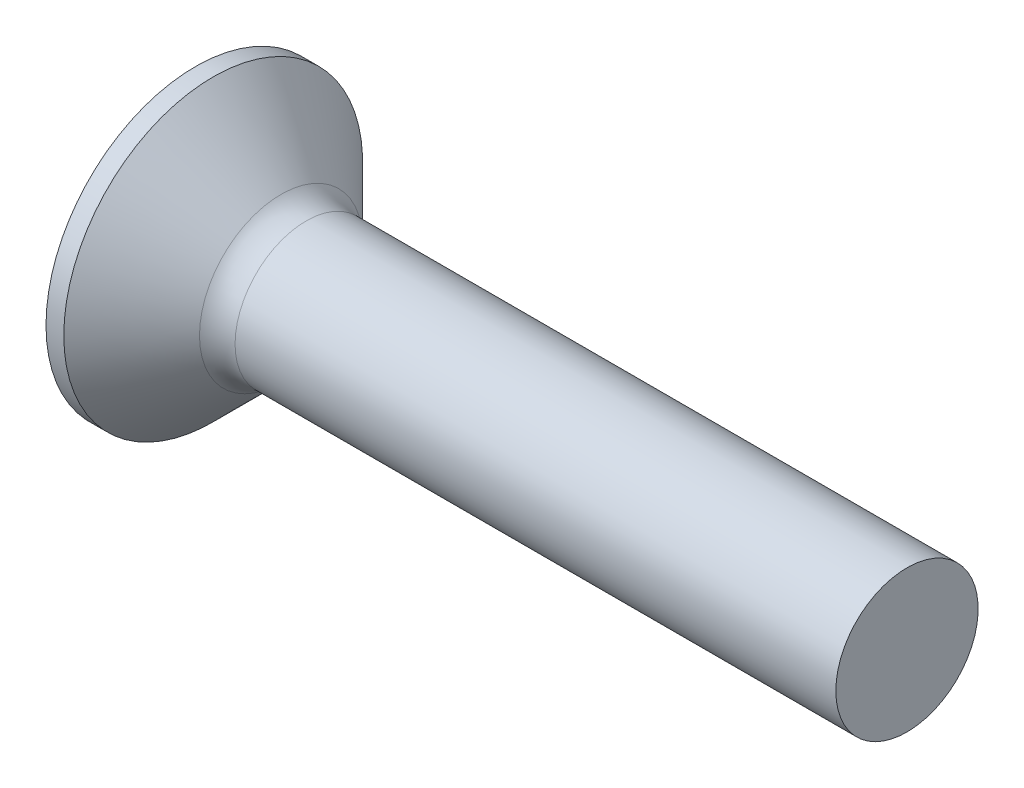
ISO-10303-21;
HEADER;
FILE_DESCRIPTION(('STEP AP214'),'2;1');
FILE_NAME('part.step','',(''),(''),'','','');
FILE_SCHEMA(('AUTOMOTIVE_DESIGN { 1 0 10303 214 1 1 1 1 }'));
ENDSEC;
DATA;
#1=APPLICATION_CONTEXT('core data for automotive mechanical design processes');
#2=APPLICATION_PROTOCOL_DEFINITION('international standard','automotive_design',2000,#1);
#3=PRODUCT_CONTEXT('',#1,'mechanical');
#4=PRODUCT('Part','Part','',(#3));
#5=PRODUCT_RELATED_PRODUCT_CATEGORY('part','',(#4));
#6=PRODUCT_DEFINITION_FORMATION('','',#4);
#7=PRODUCT_DEFINITION_CONTEXT('part definition',#1,'design');
#8=PRODUCT_DEFINITION('design','',#6,#7);
#9=PRODUCT_DEFINITION_SHAPE('','',#8);
#10=(LENGTH_UNIT() NAMED_UNIT(*) SI_UNIT(.MILLI.,.METRE.));
#11=(NAMED_UNIT(*) PLANE_ANGLE_UNIT() SI_UNIT($,.RADIAN.));
#12=(NAMED_UNIT(*) SI_UNIT($,.STERADIAN.) SOLID_ANGLE_UNIT());
#13=UNCERTAINTY_MEASURE_WITH_UNIT(LENGTH_MEASURE(1.E-05),#10,'distance_accuracy_value','');
#14=(GEOMETRIC_REPRESENTATION_CONTEXT(3) GLOBAL_UNCERTAINTY_ASSIGNED_CONTEXT((#13)) GLOBAL_UNIT_ASSIGNED_CONTEXT((#10,
#11,#12)) REPRESENTATION_CONTEXT('',''));
#15=CARTESIAN_POINT('',(0.,0.,0.));
#16=DIRECTION('',(0.,0.,1.));
#17=DIRECTION('',(1.,0.,0.));
#18=AXIS2_PLACEMENT_3D('',#15,#16,#17);
#19=CARTESIAN_POINT('',(0.,0.,0.));
#20=DIRECTION('',(-1.,0.,0.));
#21=DIRECTION('',(0.,0.,1.));
#22=AXIS2_PLACEMENT_3D('',#19,#20,#21);
#23=PLANE('',#22);
#24=CARTESIAN_POINT('',(0.,0.,0.));
#25=DIRECTION('',(-1.,0.,0.));
#26=DIRECTION('',(0.,0.,1.));
#27=AXIS2_PLACEMENT_3D('',#24,#25,#26);
#28=CIRCLE('',#27,4.2);
#29=CARTESIAN_POINT('',(0.,0.,4.2));
#30=VERTEX_POINT('',#29);
#31=EDGE_CURVE('E367',#30,#30,#28,.T.);
#32=ORIENTED_EDGE('',*,*,#31,.T.);
#33=EDGE_LOOP('',(#32));
#34=FACE_BOUND('',#33,.T.);
#35=DIRECTION('',(0.,0.,-1.));
#36=VECTOR('',#35,1.);
#37=CARTESIAN_POINT('',(0.,-0.515000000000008,2.2));
#38=LINE('',#37,#36);
#39=CARTESIAN_POINT('',(0.,-0.515000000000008,2.2));
#40=VERTEX_POINT('',#39);
#41=CARTESIAN_POINT('',(0.,-0.515000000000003,0.887981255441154));
#42=VERTEX_POINT('',#41);
#43=EDGE_CURVE('E305',#40,#42,#38,.T.);
#44=ORIENTED_EDGE('',*,*,#43,.T.);
#45=CARTESIAN_POINT('',(0.,0.,0.));
#46=DIRECTION('',(-1.,0.,0.));
#47=DIRECTION('',(0.,0.,1.));
#48=AXIS2_PLACEMENT_3D('',#45,#46,#47);
#49=CIRCLE('',#48,1.02651629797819);
#50=CARTESIAN_POINT('',(0.,-0.887981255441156,0.515));
#51=VERTEX_POINT('',#50);
#52=EDGE_CURVE('E396',#51,#42,#49,.T.);
#53=ORIENTED_EDGE('',*,*,#52,.F.);
#54=DIRECTION('',(0.,-1.,0.));
#55=VECTOR('',#54,1.);
#56=CARTESIAN_POINT('',(0.,2.2,0.515));
#57=LINE('',#56,#55);
#58=CARTESIAN_POINT('',(0.,-2.2,0.515));
#59=VERTEX_POINT('',#58);
#60=EDGE_CURVE('E331',#51,#59,#57,.T.);
#61=ORIENTED_EDGE('',*,*,#60,.T.);
#62=DIRECTION('',(0.,0.,-1.));
#63=VECTOR('',#62,1.);
#64=CARTESIAN_POINT('',(0.,-2.2,0.515));
#65=LINE('',#64,#63);
#66=CARTESIAN_POINT('',(0.,-2.2,-0.514999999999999));
#67=VERTEX_POINT('',#66);
#68=EDGE_CURVE('E336',#59,#67,#65,.T.);
#69=ORIENTED_EDGE('',*,*,#68,.T.);
#70=DIRECTION('',(0.,1.,0.));
#71=VECTOR('',#70,1.);
#72=CARTESIAN_POINT('',(0.,-2.2,-0.514999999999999));
#73=LINE('',#72,#71);
#74=CARTESIAN_POINT('',(0.,-0.887981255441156,-0.514999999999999));
#75=VERTEX_POINT('',#74);
#76=EDGE_CURVE('E332',#67,#75,#73,.T.);
#77=ORIENTED_EDGE('',*,*,#76,.T.);
#78=CARTESIAN_POINT('',(0.,-0.514999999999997,-0.887981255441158));
#79=VERTEX_POINT('',#78);
#80=EDGE_CURVE('E403',#79,#75,#49,.T.);
#81=ORIENTED_EDGE('',*,*,#80,.F.);
#82=CARTESIAN_POINT('',(0.,-0.514999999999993,-2.2));
#83=VERTEX_POINT('',#82);
#84=EDGE_CURVE('E303',#79,#83,#38,.T.);
#85=ORIENTED_EDGE('',*,*,#84,.T.);
#86=DIRECTION('',(0.,1.,0.));
#87=VECTOR('',#86,1.);
#88=CARTESIAN_POINT('',(0.,-0.514999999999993,-2.2));
#89=LINE('',#88,#87);
#90=CARTESIAN_POINT('',(0.,0.515000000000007,-2.2));
#91=VERTEX_POINT('',#90);
#92=EDGE_CURVE('E284',#83,#91,#89,.T.);
#93=ORIENTED_EDGE('',*,*,#92,.T.);
#94=DIRECTION('',(0.,0.,1.));
#95=VECTOR('',#94,1.);
#96=CARTESIAN_POINT('',(0.,0.515000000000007,-2.2));
#97=LINE('',#96,#95);
#98=CARTESIAN_POINT('',(0.,0.515000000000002,-0.887981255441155));
#99=VERTEX_POINT('',#98);
#100=EDGE_CURVE('E295',#91,#99,#97,.T.);
#101=ORIENTED_EDGE('',*,*,#100,.T.);
#102=CARTESIAN_POINT('',(0.,0.887981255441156,-0.514999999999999));
#103=VERTEX_POINT('',#102);
#104=EDGE_CURVE('E399',#103,#99,#49,.T.);
#105=ORIENTED_EDGE('',*,*,#104,.F.);
#106=CARTESIAN_POINT('',(0.,2.2,-0.514999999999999));
#107=VERTEX_POINT('',#106);
#108=EDGE_CURVE('E342',#103,#107,#73,.T.);
#109=ORIENTED_EDGE('',*,*,#108,.T.);
#110=DIRECTION('',(0.,0.,1.));
#111=VECTOR('',#110,1.);
#112=CARTESIAN_POINT('',(0.,2.2,-0.514999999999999));
#113=LINE('',#112,#111);
#114=CARTESIAN_POINT('',(0.,2.2,0.515));
#115=VERTEX_POINT('',#114);
#116=EDGE_CURVE('E328',#107,#115,#113,.T.);
#117=ORIENTED_EDGE('',*,*,#116,.T.);
#118=CARTESIAN_POINT('',(0.,0.887981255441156,0.515));
#119=VERTEX_POINT('',#118);
#120=EDGE_CURVE('E333',#115,#119,#57,.T.);
#121=ORIENTED_EDGE('',*,*,#120,.T.);
#122=CARTESIAN_POINT('',(0.,0.514999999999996,0.887981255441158));
#123=VERTEX_POINT('',#122);
#124=EDGE_CURVE('E398',#123,#119,#49,.T.);
#125=ORIENTED_EDGE('',*,*,#124,.F.);
#126=CARTESIAN_POINT('',(0.,0.514999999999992,2.2));
#127=VERTEX_POINT('',#126);
#128=EDGE_CURVE('E298',#123,#127,#97,.T.);
#129=ORIENTED_EDGE('',*,*,#128,.T.);
#130=DIRECTION('',(0.,-1.,0.));
#131=VECTOR('',#130,1.);
#132=CARTESIAN_POINT('',(0.,0.514999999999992,2.2));
#133=LINE('',#132,#131);
#134=EDGE_CURVE('E297',#127,#40,#133,.T.);
#135=ORIENTED_EDGE('',*,*,#134,.T.);
#136=EDGE_LOOP('',(#44,#53,#61,#69,#77,#81,#85,#93,#101,#105,#109,#117,#121,#125,#129,#135));
#137=FACE_BOUND('',#136,.T.);
#138=ADVANCED_FACE('F30',(#34,#137),#23,.T.);
#139=CARTESIAN_POINT('',(2.51,-0.948560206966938,0.515));
#140=DIRECTION('',(0.,0.,-1.));
#141=DIRECTION('',(0.,1.,0.));
#142=AXIS2_PLACEMENT_3D('',#139,#140,#141);
#143=PLANE('',#142);
#144=ORIENTED_EDGE('',*,*,#60,.F.);
#145=CARTESIAN_POINT('',(-1.54977564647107,-1.01130800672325,0.515));
#146=CARTESIAN_POINT('',(-1.23788517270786,-0.986826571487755,0.515));
#147=CARTESIAN_POINT('',(-0.92600773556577,-0.962176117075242,0.515));
#148=CARTESIAN_POINT('',(-0.302275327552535,-0.912414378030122,0.515));
#149=CARTESIAN_POINT('',(0.0095796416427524,-0.88730307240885,0.515));
#150=CARTESIAN_POINT('',(0.477326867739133,-0.849200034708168,0.515));
#151=CARTESIAN_POINT('',(0.633236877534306,-0.836426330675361,0.515));
#152=CARTESIAN_POINT('',(0.945041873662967,-0.810710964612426,0.515));
#153=CARTESIAN_POINT('',(1.10093686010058,-0.797769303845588,0.515));
#154=CARTESIAN_POINT('',(1.41270333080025,-0.771692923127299,0.515));
#155=CARTESIAN_POINT('',(1.568574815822,-0.758558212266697,0.515));
#156=CARTESIAN_POINT('',(1.88030267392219,-0.732062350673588,0.515));
#157=CARTESIAN_POINT('',(2.03615904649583,-0.718701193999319,0.515));
#158=CARTESIAN_POINT('',(2.39015155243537,-0.688049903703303,0.515));
#159=CARTESIAN_POINT('',(2.58828060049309,-0.670677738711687,0.515));
#160=CARTESIAN_POINT('',(2.98448796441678,-0.63539350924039,0.515));
#161=CARTESIAN_POINT('',(3.18256628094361,-0.617481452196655,0.515));
#162=CARTESIAN_POINT('',(3.57863215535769,-0.58096323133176,0.515));
#163=CARTESIAN_POINT('',(3.77661972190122,-0.562357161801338,0.515));
#164=CARTESIAN_POINT('',(4.17251625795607,-0.524212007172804,0.515));
#165=CARTESIAN_POINT('',(4.37042522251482,-0.504672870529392,0.515));
#166=CARTESIAN_POINT('',(4.76621979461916,-0.464285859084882,0.515));
#167=CARTESIAN_POINT('',(4.96410533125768,-0.443437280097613,0.515000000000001));
#168=CARTESIAN_POINT('',(5.26075347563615,-0.410686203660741,0.515000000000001));
#169=CARTESIAN_POINT('',(5.35959766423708,-0.399523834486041,0.515000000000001));
#170=CARTESIAN_POINT('',(5.55721694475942,-0.376561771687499,0.515000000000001));
#171=CARTESIAN_POINT('',(5.65599203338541,-0.364762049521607,0.515000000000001));
#172=CARTESIAN_POINT('',(5.85350341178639,-0.340311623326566,0.515000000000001));
#173=CARTESIAN_POINT('',(5.95223963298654,-0.327660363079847,0.515000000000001));
#174=CARTESIAN_POINT('',(6.14954565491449,-0.301187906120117,0.515000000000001));
#175=CARTESIAN_POINT('',(6.24811547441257,-0.28736685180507,0.515000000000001));
#176=CARTESIAN_POINT('',(6.39580251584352,-0.265292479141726,0.515000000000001));
#177=CARTESIAN_POINT('',(6.44501926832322,-0.257707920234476,0.515000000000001));
#178=CARTESIAN_POINT('',(6.54335575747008,-0.241951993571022,0.515000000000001));
#179=CARTESIAN_POINT('',(6.59247550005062,-0.233780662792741,0.515000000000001));
#180=CARTESIAN_POINT('',(6.69060451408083,-0.216664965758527,0.515000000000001));
#181=CARTESIAN_POINT('',(6.73961373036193,-0.207720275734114,0.515000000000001));
#182=CARTESIAN_POINT('',(6.83741121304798,-0.188649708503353,0.515000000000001));
#183=CARTESIAN_POINT('',(6.8861994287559,-0.17852357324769,0.515000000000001));
#184=CARTESIAN_POINT('',(6.93482152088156,-0.167602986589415,0.515000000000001));
#185=B_SPLINE_CURVE_WITH_KNOTS('',3,(#145,#146,#147,#148,#149,#150,#151,#152,#153,#154,#155,
#156,#157,#158,#159,#160,#161,#162,#163,#164,#165,#166,#167,#168,#169,#170,#171,#172,#173,#174,
#175,#176,#177,#178,#179,#180,#181,#182,#183,#184),.UNSPECIFIED.,.F.,.F.,(4,2,2,2,2,2,2,2,2,2,2,
2,2,2,2,2,2,2,2,4),(0.,0.938549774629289,1.87714240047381,2.34643955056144,2.81573317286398,
3.28500476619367,3.75428869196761,4.35095567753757,4.94761444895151,5.54419244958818,
6.14080344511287,6.73773807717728,7.0361540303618,7.33458335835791,7.63320954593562,
7.93179943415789,8.08118980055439,8.23057076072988,8.38001456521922,8.52949107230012),.UNSPECIFIED.);
#186=CARTESIAN_POINT('',(2.51,-0.677477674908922,0.514999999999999));
#187=VERTEX_POINT('',#186);
#188=EDGE_CURVE('E410',#51,#187,#185,.T.);
#189=ORIENTED_EDGE('',*,*,#188,.T.);
#190=DIRECTION('',(0.,-1.,0.));
#191=VECTOR('',#190,1.);
#192=CARTESIAN_POINT('',(2.51,0.948560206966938,0.515));
#193=LINE('',#192,#191);
#194=CARTESIAN_POINT('',(2.51,-0.948560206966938,0.515));
#195=VERTEX_POINT('',#194);
#196=EDGE_CURVE('E356',#187,#195,#193,.T.);
#197=ORIENTED_EDGE('',*,*,#196,.T.);
#198=DIRECTION('',(0.89493436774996,0.446197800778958,0.));
#199=VECTOR('',#198,1.);
#200=CARTESIAN_POINT('',(0.,-2.2,0.515));
#201=LINE('',#200,#199);
#202=EDGE_CURVE('E343',#59,#195,#201,.T.);
#203=ORIENTED_EDGE('',*,*,#202,.F.);
#204=EDGE_LOOP('',(#144,#189,#197,#203));
#205=FACE_BOUND('',#204,.T.);
#206=ADVANCED_FACE('F162',(#205),#143,.T.);
#207=CARTESIAN_POINT('',(2.51,0.948560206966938,0.515));
#208=VERTEX_POINT('',#207);
#209=CARTESIAN_POINT('',(2.51,0.677477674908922,0.514999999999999));
#210=VERTEX_POINT('',#209);
#211=EDGE_CURVE('E357',#208,#210,#193,.T.);
#212=ORIENTED_EDGE('',*,*,#211,.T.);
#213=CARTESIAN_POINT('',(-1.54977564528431,1.01130800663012,0.515));
#214=CARTESIAN_POINT('',(-1.23788517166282,0.986826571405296,0.515));
#215=CARTESIAN_POINT('',(-0.926007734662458,0.962176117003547,0.515));
#216=CARTESIAN_POINT('',(-0.302275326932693,0.91241437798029,0.515));
#217=CARTESIAN_POINT('',(0.0095796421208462,0.887303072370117,0.515));
#218=CARTESIAN_POINT('',(0.477326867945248,0.849200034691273,0.515));
#219=CARTESIAN_POINT('',(0.63323687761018,0.836426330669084,0.515));
#220=CARTESIAN_POINT('',(0.945041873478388,0.810710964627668,0.515));
#221=CARTESIAN_POINT('',(1.10093685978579,0.797769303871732,0.515));
#222=CARTESIAN_POINT('',(1.41270333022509,0.771692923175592,0.515));
#223=CARTESIAN_POINT('',(1.56857481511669,0.758558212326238,0.515));
#224=CARTESIAN_POINT('',(1.8803026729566,0.732062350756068,0.515));
#225=CARTESIAN_POINT('',(2.03615904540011,0.718701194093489,0.515));
#226=CARTESIAN_POINT('',(2.39015155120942,0.688049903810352,0.515));
#227=CARTESIAN_POINT('',(2.58828059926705,0.670677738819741,0.515));
#228=CARTESIAN_POINT('',(2.98448796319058,0.635393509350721,0.515));
#229=CARTESIAN_POINT('',(3.18256627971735,0.617481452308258,0.515));
#230=CARTESIAN_POINT('',(3.57863215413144,0.580963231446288,0.515));
#231=CARTESIAN_POINT('',(3.77661972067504,0.56235716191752,0.515));
#232=CARTESIAN_POINT('',(4.17251625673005,0.524212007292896,0.515));
#233=CARTESIAN_POINT('',(4.37042522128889,0.504672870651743,0.515));
#234=CARTESIAN_POINT('',(4.76621979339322,0.464285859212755,0.515));
#235=CARTESIAN_POINT('',(4.96410533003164,0.443437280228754,0.515));
#236=CARTESIAN_POINT('',(5.26075347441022,0.410686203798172,0.515));
#237=CARTESIAN_POINT('',(5.35959766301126,0.399523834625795,0.515));
#238=CARTESIAN_POINT('',(5.5572169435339,0.376561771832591,0.515));
#239=CARTESIAN_POINT('',(5.65599203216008,0.364762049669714,0.515000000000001));
#240=CARTESIAN_POINT('',(5.85350341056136,0.340311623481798,0.515000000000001));
#241=CARTESIAN_POINT('',(5.95223963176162,0.327660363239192,0.515000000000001));
#242=CARTESIAN_POINT('',(6.14954565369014,0.301187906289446,0.515000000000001));
#243=CARTESIAN_POINT('',(6.24811547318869,0.28736685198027,0.515000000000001));
#244=CARTESIAN_POINT('',(6.39580251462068,0.265292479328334,0.515000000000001));
#245=CARTESIAN_POINT('',(6.44501926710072,0.257707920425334,0.515000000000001));
#246=CARTESIAN_POINT('',(6.54335575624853,0.241951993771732,0.515000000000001));
#247=CARTESIAN_POINT('',(6.5924754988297,0.233780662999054,0.515000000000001));
#248=CARTESIAN_POINT('',(6.69060451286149,0.216664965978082,0.515000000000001));
#249=CARTESIAN_POINT('',(6.73961372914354,0.207720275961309,0.515000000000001));
#250=CARTESIAN_POINT('',(6.83741121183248,0.18864970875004,0.515000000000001));
#251=CARTESIAN_POINT('',(6.88619942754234,0.178523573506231,0.515000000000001));
#252=CARTESIAN_POINT('',(6.9348215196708,0.167602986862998,0.515000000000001));
#253=B_SPLINE_CURVE_WITH_KNOTS('',3,(#213,#214,#215,#216,#217,#218,#219,#220,#221,#222,#223,
#224,#225,#226,#227,#228,#229,#230,#231,#232,#233,#234,#235,#236,#237,#238,#239,#240,#241,#242,
#243,#244,#245,#246,#247,#248,#249,#250,#251,#252),.UNSPECIFIED.,.F.,.F.,(4,2,2,2,2,2,2,2,2,2,2,
2,2,2,2,2,2,2,2,4),(0.,0.938549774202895,1.87714239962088,2.34643954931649,2.81573317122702,
3.2850047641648,3.75428868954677,4.35095567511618,4.9476144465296,5.544192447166,
6.1408034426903,6.73773807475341,7.03615402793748,7.33458335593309,7.63320954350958,
7.93179943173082,8.08118979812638,8.23057075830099,8.38001456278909,8.5294910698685),.UNSPECIFIED.);
#254=EDGE_CURVE('E222',#210,#119,#253,.F.);
#255=ORIENTED_EDGE('',*,*,#254,.T.);
#256=ORIENTED_EDGE('',*,*,#120,.F.);
#257=DIRECTION('',(0.89493436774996,-0.446197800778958,0.));
#258=VECTOR('',#257,1.);
#259=CARTESIAN_POINT('',(0.,2.2,0.515));
#260=LINE('',#259,#258);
#261=EDGE_CURVE('E58',#115,#208,#260,.T.);
#262=ORIENTED_EDGE('',*,*,#261,.T.);
#263=EDGE_LOOP('',(#212,#255,#256,#262));
#264=FACE_BOUND('',#263,.T.);
#265=ADVANCED_FACE('F167',(#264),#143,.T.);
#266=CARTESIAN_POINT('',(2.51,0.948560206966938,-0.515));
#267=DIRECTION('',(0.,0.,1.));
#268=DIRECTION('',(1.,0.,0.));
#269=AXIS2_PLACEMENT_3D('',#266,#267,#268);
#270=PLANE('',#269);
#271=DIRECTION('',(0.,1.,0.));
#272=VECTOR('',#271,1.);
#273=CARTESIAN_POINT('',(2.51,-0.948560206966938,-0.515));
#274=LINE('',#273,#272);
#275=CARTESIAN_POINT('',(2.51,-0.948560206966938,-0.515));
#276=VERTEX_POINT('',#275);
#277=CARTESIAN_POINT('',(2.51,-0.677477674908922,-0.514999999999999));
#278=VERTEX_POINT('',#277);
#279=EDGE_CURVE('E307',#276,#278,#274,.T.);
#280=ORIENTED_EDGE('',*,*,#279,.T.);
#281=CARTESIAN_POINT('',(-1.54977564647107,-1.01130800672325,-0.514999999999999));
#282=CARTESIAN_POINT('',(-1.23788517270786,-0.986826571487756,-0.514999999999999));
#283=CARTESIAN_POINT('',(-0.92600773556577,-0.962176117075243,-0.514999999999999));
#284=CARTESIAN_POINT('',(-0.302275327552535,-0.912414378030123,-0.514999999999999));
#285=CARTESIAN_POINT('',(0.00957964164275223,-0.88730307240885,-0.514999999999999));
#286=CARTESIAN_POINT('',(0.477326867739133,-0.849200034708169,-0.514999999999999));
#287=CARTESIAN_POINT('',(0.633236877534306,-0.836426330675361,-0.515));
#288=CARTESIAN_POINT('',(0.945041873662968,-0.810710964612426,-0.515));
#289=CARTESIAN_POINT('',(1.10093686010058,-0.797769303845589,-0.515));
#290=CARTESIAN_POINT('',(1.41270333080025,-0.771692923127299,-0.515));
#291=CARTESIAN_POINT('',(1.568574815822,-0.758558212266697,-0.515));
#292=CARTESIAN_POINT('',(1.88030267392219,-0.732062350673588,-0.515));
#293=CARTESIAN_POINT('',(2.03615904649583,-0.718701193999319,-0.515));
#294=CARTESIAN_POINT('',(2.39015155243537,-0.688049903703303,-0.515));
#295=CARTESIAN_POINT('',(2.58828060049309,-0.670677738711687,-0.515));
#296=CARTESIAN_POINT('',(2.98448796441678,-0.63539350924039,-0.515));
#297=CARTESIAN_POINT('',(3.18256628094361,-0.617481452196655,-0.515));
#298=CARTESIAN_POINT('',(3.57863215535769,-0.58096323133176,-0.515));
#299=CARTESIAN_POINT('',(3.77661972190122,-0.562357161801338,-0.515));
#300=CARTESIAN_POINT('',(4.17251625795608,-0.524212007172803,-0.515000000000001));
#301=CARTESIAN_POINT('',(4.37042522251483,-0.504672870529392,-0.515000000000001));
#302=CARTESIAN_POINT('',(4.76621979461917,-0.464285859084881,-0.515000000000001));
#303=CARTESIAN_POINT('',(4.96410533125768,-0.443437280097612,-0.515000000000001));
#304=CARTESIAN_POINT('',(5.26075347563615,-0.410686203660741,-0.515000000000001));
#305=CARTESIAN_POINT('',(5.35959766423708,-0.39952383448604,-0.515000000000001));
#306=CARTESIAN_POINT('',(5.55721694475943,-0.376561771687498,-0.515000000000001));
#307=CARTESIAN_POINT('',(5.65599203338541,-0.364762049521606,-0.515000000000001));
#308=CARTESIAN_POINT('',(5.8535034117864,-0.340311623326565,-0.515000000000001));
#309=CARTESIAN_POINT('',(5.95223963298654,-0.327660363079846,-0.515000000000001));
#310=CARTESIAN_POINT('',(6.14954565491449,-0.301187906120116,-0.515000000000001));
#311=CARTESIAN_POINT('',(6.24811547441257,-0.287366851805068,-0.515000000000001));
#312=CARTESIAN_POINT('',(6.39580251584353,-0.265292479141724,-0.515000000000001));
#313=CARTESIAN_POINT('',(6.44501926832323,-0.257707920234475,-0.515000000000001));
#314=CARTESIAN_POINT('',(6.54335575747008,-0.24195199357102,-0.515000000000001));
#315=CARTESIAN_POINT('',(6.59247550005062,-0.233780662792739,-0.515000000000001));
#316=CARTESIAN_POINT('',(6.69060451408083,-0.216664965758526,-0.515000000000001));
#317=CARTESIAN_POINT('',(6.73961373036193,-0.207720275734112,-0.515000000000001));
#318=CARTESIAN_POINT('',(6.83741121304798,-0.188649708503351,-0.515000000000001));
#319=CARTESIAN_POINT('',(6.88619942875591,-0.178523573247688,-0.515000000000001));
#320=CARTESIAN_POINT('',(6.93482152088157,-0.167602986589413,-0.515000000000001));
#321=B_SPLINE_CURVE_WITH_KNOTS('',3,(#281,#282,#283,#284,#285,#286,#287,#288,#289,#290,#291,
#292,#293,#294,#295,#296,#297,#298,#299,#300,#301,#302,#303,#304,#305,#306,#307,#308,#309,#310,
#311,#312,#313,#314,#315,#316,#317,#318,#319,#320),.UNSPECIFIED.,.F.,.F.,(4,2,2,2,2,2,2,2,2,2,2,
2,2,2,2,2,2,2,2,4),(0.,0.938549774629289,1.87714240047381,2.34643955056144,2.81573317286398,
3.28500476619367,3.75428869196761,4.35095567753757,4.94761444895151,5.54419244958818,
6.14080344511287,6.73773807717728,7.0361540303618,7.33458335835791,7.63320954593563,
7.93179943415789,8.0811898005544,8.23057076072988,8.38001456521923,8.52949107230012),.UNSPECIFIED.);
#322=EDGE_CURVE('E216',#278,#75,#321,.F.);
#323=ORIENTED_EDGE('',*,*,#322,.T.);
#324=ORIENTED_EDGE('',*,*,#76,.F.);
#325=DIRECTION('',(0.89493436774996,0.446197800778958,0.));
#326=VECTOR('',#325,1.);
#327=CARTESIAN_POINT('',(0.,-2.2,-0.514999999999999));
#328=LINE('',#327,#326);
#329=EDGE_CURVE('E346',#67,#276,#328,.T.);
#330=ORIENTED_EDGE('',*,*,#329,.T.);
#331=EDGE_LOOP('',(#280,#323,#324,#330));
#332=FACE_BOUND('',#331,.T.);
#333=ADVANCED_FACE('F202',(#332),#270,.T.);
#334=ORIENTED_EDGE('',*,*,#108,.F.);
#335=CARTESIAN_POINT('',(-1.54977564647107,1.01130800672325,-0.514999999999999));
#336=CARTESIAN_POINT('',(-1.23788517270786,0.986826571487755,-0.514999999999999));
#337=CARTESIAN_POINT('',(-0.92600773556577,0.962176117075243,-0.514999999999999));
#338=CARTESIAN_POINT('',(-0.302275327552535,0.912414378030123,-0.514999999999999));
#339=CARTESIAN_POINT('',(0.00957964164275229,0.88730307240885,-0.514999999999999));
#340=CARTESIAN_POINT('',(0.477326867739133,0.849200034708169,-0.514999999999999));
#341=CARTESIAN_POINT('',(0.633236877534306,0.836426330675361,-0.515));
#342=CARTESIAN_POINT('',(0.945041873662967,0.810710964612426,-0.515));
#343=CARTESIAN_POINT('',(1.10093686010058,0.797769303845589,-0.515));
#344=CARTESIAN_POINT('',(1.41270333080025,0.771692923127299,-0.515));
#345=CARTESIAN_POINT('',(1.568574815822,0.758558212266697,-0.515));
#346=CARTESIAN_POINT('',(1.88030267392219,0.732062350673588,-0.515));
#347=CARTESIAN_POINT('',(2.03615904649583,0.718701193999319,-0.515));
#348=CARTESIAN_POINT('',(2.39015155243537,0.688049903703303,-0.515));
#349=CARTESIAN_POINT('',(2.58828060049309,0.670677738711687,-0.515));
#350=CARTESIAN_POINT('',(2.98448796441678,0.63539350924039,-0.515));
#351=CARTESIAN_POINT('',(3.18256628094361,0.617481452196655,-0.515));
#352=CARTESIAN_POINT('',(3.57863215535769,0.58096323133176,-0.515));
#353=CARTESIAN_POINT('',(3.77661972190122,0.562357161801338,-0.515));
#354=CARTESIAN_POINT('',(4.17251625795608,0.524212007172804,-0.515000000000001));
#355=CARTESIAN_POINT('',(4.37042522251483,0.504672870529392,-0.515000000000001));
#356=CARTESIAN_POINT('',(4.76621979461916,0.464285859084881,-0.515000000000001));
#357=CARTESIAN_POINT('',(4.96410533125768,0.443437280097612,-0.515000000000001));
#358=CARTESIAN_POINT('',(5.26075347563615,0.410686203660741,-0.515000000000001));
#359=CARTESIAN_POINT('',(5.35959766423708,0.39952383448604,-0.515000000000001));
#360=CARTESIAN_POINT('',(5.55721694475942,0.376561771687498,-0.515000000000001));
#361=CARTESIAN_POINT('',(5.65599203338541,0.364762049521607,-0.515000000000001));
#362=CARTESIAN_POINT('',(5.8535034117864,0.340311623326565,-0.515000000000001));
#363=CARTESIAN_POINT('',(5.95223963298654,0.327660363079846,-0.515000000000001));
#364=CARTESIAN_POINT('',(6.14954565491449,0.301187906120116,-0.515000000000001));
#365=CARTESIAN_POINT('',(6.24811547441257,0.287366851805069,-0.515000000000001));
#366=CARTESIAN_POINT('',(6.39580251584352,0.265292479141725,-0.515000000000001));
#367=CARTESIAN_POINT('',(6.44501926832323,0.257707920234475,-0.515000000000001));
#368=CARTESIAN_POINT('',(6.54335575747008,0.24195199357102,-0.515000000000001));
#369=CARTESIAN_POINT('',(6.59247550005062,0.233780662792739,-0.515000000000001));
#370=CARTESIAN_POINT('',(6.69060451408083,0.216664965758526,-0.515000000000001));
#371=CARTESIAN_POINT('',(6.73961373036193,0.207720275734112,-0.515000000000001));
#372=CARTESIAN_POINT('',(6.83741121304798,0.188649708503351,-0.515000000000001));
#373=CARTESIAN_POINT('',(6.88619942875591,0.178523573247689,-0.515000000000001));
#374=CARTESIAN_POINT('',(6.93482152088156,0.167602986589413,-0.515000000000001));
#375=B_SPLINE_CURVE_WITH_KNOTS('',3,(#335,#336,#337,#338,#339,#340,#341,#342,#343,#344,#345,
#346,#347,#348,#349,#350,#351,#352,#353,#354,#355,#356,#357,#358,#359,#360,#361,#362,#363,#364,
#365,#366,#367,#368,#369,#370,#371,#372,#373,#374),.UNSPECIFIED.,.F.,.F.,(4,2,2,2,2,2,2,2,2,2,2,
2,2,2,2,2,2,2,2,4),(0.,0.938549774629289,1.87714240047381,2.34643955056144,2.81573317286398,
3.28500476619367,3.75428869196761,4.35095567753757,4.94761444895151,5.54419244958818,
6.14080344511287,6.73773807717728,7.0361540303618,7.33458335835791,7.63320954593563,
7.93179943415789,8.0811898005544,8.23057076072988,8.38001456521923,8.52949107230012),.UNSPECIFIED.);
#376=CARTESIAN_POINT('',(2.51,0.677477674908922,-0.514999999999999));
#377=VERTEX_POINT('',#376);
#378=EDGE_CURVE('E210',#103,#377,#375,.T.);
#379=ORIENTED_EDGE('',*,*,#378,.T.);
#380=CARTESIAN_POINT('',(2.51,0.948560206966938,-0.515));
#381=VERTEX_POINT('',#380);
#382=EDGE_CURVE('E304',#377,#381,#274,.T.);
#383=ORIENTED_EDGE('',*,*,#382,.T.);
#384=DIRECTION('',(0.89493436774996,-0.446197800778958,0.));
#385=VECTOR('',#384,1.);
#386=CARTESIAN_POINT('',(0.,2.2,-0.514999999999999));
#387=LINE('',#386,#385);
#388=EDGE_CURVE('E350',#107,#381,#387,.T.);
#389=ORIENTED_EDGE('',*,*,#388,.F.);
#390=EDGE_LOOP('',(#334,#379,#383,#389));
#391=FACE_BOUND('',#390,.T.);
#392=ADVANCED_FACE('F194',(#391),#270,.T.);
#393=CARTESIAN_POINT('',(2.51,-0.948560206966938,-0.515));
#394=DIRECTION('',(-1.,0.,0.));
#395=DIRECTION('',(0.,0.,1.));
#396=AXIS2_PLACEMENT_3D('',#393,#394,#395);
#397=PLANE('',#396);
#398=ORIENTED_EDGE('',*,*,#196,.F.);
#399=CARTESIAN_POINT('',(2.51,0.,0.));
#400=DIRECTION('',(-1.,0.,0.));
#401=DIRECTION('',(0.,0.,1.));
#402=AXIS2_PLACEMENT_3D('',#399,#400,#401);
#403=CIRCLE('',#402,0.850999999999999);
#404=EDGE_CURVE('E387',#278,#187,#403,.T.);
#405=ORIENTED_EDGE('',*,*,#404,.F.);
#406=ORIENTED_EDGE('',*,*,#279,.F.);
#407=DIRECTION('',(0.,0.,-1.));
#408=VECTOR('',#407,1.);
#409=CARTESIAN_POINT('',(2.51,-0.948560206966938,0.515));
#410=LINE('',#409,#408);
#411=EDGE_CURVE('E353',#195,#276,#410,.T.);
#412=ORIENTED_EDGE('',*,*,#411,.F.);
#413=EDGE_LOOP('',(#398,#405,#406,#412));
#414=FACE_BOUND('',#413,.T.);
#415=ADVANCED_FACE('F190',(#414),#397,.T.);
#416=DIRECTION('',(0.,0.,-1.));
#417=VECTOR('',#416,1.);
#418=CARTESIAN_POINT('',(2.51,-0.515000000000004,0.948560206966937));
#419=LINE('',#418,#417);
#420=CARTESIAN_POINT('',(2.51,-0.514999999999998,-0.677477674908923));
#421=VERTEX_POINT('',#420);
#422=CARTESIAN_POINT('',(2.51,-0.514999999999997,-0.94856020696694));
#423=VERTEX_POINT('',#422);
#424=EDGE_CURVE('E320',#421,#423,#419,.T.);
#425=ORIENTED_EDGE('',*,*,#424,.F.);
#426=CARTESIAN_POINT('',(2.51,0.515000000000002,-0.677477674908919));
#427=VERTEX_POINT('',#426);
#428=EDGE_CURVE('E394',#427,#421,#403,.T.);
#429=ORIENTED_EDGE('',*,*,#428,.F.);
#430=DIRECTION('',(0.,0.,1.));
#431=VECTOR('',#430,1.);
#432=CARTESIAN_POINT('',(2.51,0.515000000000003,-0.948560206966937));
#433=LINE('',#432,#431);
#434=CARTESIAN_POINT('',(2.51,0.515000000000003,-0.948560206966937));
#435=VERTEX_POINT('',#434);
#436=EDGE_CURVE('E321',#435,#427,#433,.T.);
#437=ORIENTED_EDGE('',*,*,#436,.F.);
#438=DIRECTION('',(0.,1.,0.));
#439=VECTOR('',#438,1.);
#440=CARTESIAN_POINT('',(2.51,-0.514999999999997,-0.94856020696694));
#441=LINE('',#440,#439);
#442=EDGE_CURVE('E287',#423,#435,#441,.T.);
#443=ORIENTED_EDGE('',*,*,#442,.F.);
#444=EDGE_LOOP('',(#425,#429,#437,#443));
#445=FACE_BOUND('',#444,.T.);
#446=ADVANCED_FACE('F193',(#445),#397,.T.);
#447=ORIENTED_EDGE('',*,*,#382,.F.);
#448=EDGE_CURVE('E397',#210,#377,#403,.T.);
#449=ORIENTED_EDGE('',*,*,#448,.F.);
#450=ORIENTED_EDGE('',*,*,#211,.F.);
#451=DIRECTION('',(0.,0.,1.));
#452=VECTOR('',#451,1.);
#453=CARTESIAN_POINT('',(2.51,0.948560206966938,-0.515));
#454=LINE('',#453,#452);
#455=EDGE_CURVE('E354',#381,#208,#454,.T.);
#456=ORIENTED_EDGE('',*,*,#455,.F.);
#457=EDGE_LOOP('',(#447,#449,#450,#456));
#458=FACE_BOUND('',#457,.T.);
#459=ADVANCED_FACE('F426',(#458),#397,.T.);
#460=CARTESIAN_POINT('',(2.51,0.514999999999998,0.677477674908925));
#461=VERTEX_POINT('',#460);
#462=CARTESIAN_POINT('',(2.51,0.514999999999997,0.94856020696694));
#463=VERTEX_POINT('',#462);
#464=EDGE_CURVE('E327',#461,#463,#433,.T.);
#465=ORIENTED_EDGE('',*,*,#464,.F.);
#466=CARTESIAN_POINT('',(2.51,-0.515000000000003,0.677477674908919));
#467=VERTEX_POINT('',#466);
#468=EDGE_CURVE('E395',#467,#461,#403,.T.);
#469=ORIENTED_EDGE('',*,*,#468,.F.);
#470=CARTESIAN_POINT('',(2.51,-0.515000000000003,0.948560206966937));
#471=VERTEX_POINT('',#470);
#472=EDGE_CURVE('E322',#471,#467,#419,.T.);
#473=ORIENTED_EDGE('',*,*,#472,.F.);
#474=DIRECTION('',(0.,-1.,0.));
#475=VECTOR('',#474,1.);
#476=CARTESIAN_POINT('',(2.51,0.514999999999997,0.94856020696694));
#477=LINE('',#476,#475);
#478=EDGE_CURVE('E317',#463,#471,#477,.T.);
#479=ORIENTED_EDGE('',*,*,#478,.F.);
#480=EDGE_LOOP('',(#465,#469,#473,#479));
#481=FACE_BOUND('',#480,.T.);
#482=ADVANCED_FACE('F196',(#481),#397,.T.);
#483=CARTESIAN_POINT('',(2.51,-0.514999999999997,-0.94856020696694));
#484=DIRECTION('',(0.,1.,0.));
#485=DIRECTION('',(0.,0.,1.));
#486=AXIS2_PLACEMENT_3D('',#483,#484,#485);
#487=PLANE('',#486);
#488=ORIENTED_EDGE('',*,*,#84,.F.);
#489=CARTESIAN_POINT('',(-1.54977564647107,-0.514999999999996,-1.01130800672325));
#490=CARTESIAN_POINT('',(-1.23788517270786,-0.514999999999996,-0.986826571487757));
#491=CARTESIAN_POINT('',(-0.92600773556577,-0.514999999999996,-0.962176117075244));
#492=CARTESIAN_POINT('',(-0.302275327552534,-0.514999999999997,-0.912414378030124));
#493=CARTESIAN_POINT('',(0.00957964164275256,-0.514999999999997,-0.887303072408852));
#494=CARTESIAN_POINT('',(0.477326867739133,-0.514999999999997,-0.84920003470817));
#495=CARTESIAN_POINT('',(0.633236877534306,-0.514999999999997,-0.836426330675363));
#496=CARTESIAN_POINT('',(0.945041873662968,-0.514999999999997,-0.810710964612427));
#497=CARTESIAN_POINT('',(1.10093686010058,-0.514999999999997,-0.79776930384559));
#498=CARTESIAN_POINT('',(1.41270333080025,-0.514999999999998,-0.771692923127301));
#499=CARTESIAN_POINT('',(1.568574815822,-0.514999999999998,-0.758558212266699));
#500=CARTESIAN_POINT('',(1.88030267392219,-0.514999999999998,-0.73206235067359));
#501=CARTESIAN_POINT('',(2.03615904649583,-0.514999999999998,-0.718701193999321));
#502=CARTESIAN_POINT('',(2.39015155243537,-0.514999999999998,-0.688049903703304));
#503=CARTESIAN_POINT('',(2.58828060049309,-0.514999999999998,-0.670677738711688));
#504=CARTESIAN_POINT('',(2.98448796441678,-0.514999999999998,-0.635393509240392));
#505=CARTESIAN_POINT('',(3.18256628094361,-0.514999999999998,-0.617481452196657));
#506=CARTESIAN_POINT('',(3.57863215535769,-0.514999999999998,-0.580963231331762));
#507=CARTESIAN_POINT('',(3.77661972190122,-0.514999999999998,-0.56235716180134));
#508=CARTESIAN_POINT('',(4.17251625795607,-0.514999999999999,-0.524212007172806));
#509=CARTESIAN_POINT('',(4.37042522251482,-0.514999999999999,-0.504672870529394));
#510=CARTESIAN_POINT('',(4.76621979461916,-0.514999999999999,-0.464285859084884));
#511=CARTESIAN_POINT('',(4.96410533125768,-0.514999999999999,-0.443437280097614));
#512=CARTESIAN_POINT('',(5.26075347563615,-0.514999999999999,-0.410686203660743));
#513=CARTESIAN_POINT('',(5.35959766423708,-0.514999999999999,-0.399523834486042));
#514=CARTESIAN_POINT('',(5.55721694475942,-0.514999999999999,-0.3765617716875));
#515=CARTESIAN_POINT('',(5.65599203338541,-0.514999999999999,-0.364762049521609));
#516=CARTESIAN_POINT('',(5.8535034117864,-0.514999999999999,-0.340311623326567));
#517=CARTESIAN_POINT('',(5.95223963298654,-0.514999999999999,-0.327660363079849));
#518=CARTESIAN_POINT('',(6.14954565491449,-0.515,-0.301187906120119));
#519=CARTESIAN_POINT('',(6.24811547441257,-0.515,-0.287366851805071));
#520=CARTESIAN_POINT('',(6.39580251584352,-0.515,-0.265292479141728));
#521=CARTESIAN_POINT('',(6.44501926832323,-0.515,-0.257707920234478));
#522=CARTESIAN_POINT('',(6.54335575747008,-0.515,-0.241951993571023));
#523=CARTESIAN_POINT('',(6.59247550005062,-0.515,-0.233780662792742));
#524=CARTESIAN_POINT('',(6.69060451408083,-0.515,-0.216664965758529));
#525=CARTESIAN_POINT('',(6.73961373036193,-0.515,-0.207720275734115));
#526=CARTESIAN_POINT('',(6.83741121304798,-0.515,-0.188649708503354));
#527=CARTESIAN_POINT('',(6.88619942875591,-0.515,-0.178523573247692));
#528=CARTESIAN_POINT('',(6.93482152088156,-0.515,-0.167602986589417));
#529=B_SPLINE_CURVE_WITH_KNOTS('',3,(#489,#490,#491,#492,#493,#494,#495,#496,#497,#498,#499,
#500,#501,#502,#503,#504,#505,#506,#507,#508,#509,#510,#511,#512,#513,#514,#515,#516,#517,#518,
#519,#520,#521,#522,#523,#524,#525,#526,#527,#528),.UNSPECIFIED.,.F.,.F.,(4,2,2,2,2,2,2,2,2,2,2,
2,2,2,2,2,2,2,2,4),(0.,0.938549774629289,1.87714240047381,2.34643955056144,2.81573317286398,
3.28500476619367,3.75428869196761,4.35095567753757,4.94761444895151,5.54419244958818,
6.14080344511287,6.73773807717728,7.03615403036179,7.33458335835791,7.63320954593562,
7.93179943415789,8.08118980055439,8.23057076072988,8.38001456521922,8.52949107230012),.UNSPECIFIED.);
#530=EDGE_CURVE('E247',#79,#421,#529,.T.);
#531=ORIENTED_EDGE('',*,*,#530,.T.);
#532=ORIENTED_EDGE('',*,*,#424,.T.);
#533=DIRECTION('',(0.89493436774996,0.,0.446197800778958));
#534=VECTOR('',#533,1.);
#535=CARTESIAN_POINT('',(0.,-0.514999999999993,-2.2));
#536=LINE('',#535,#534);
#537=EDGE_CURVE('E290',#83,#423,#536,.T.);
#538=ORIENTED_EDGE('',*,*,#537,.F.);
#539=EDGE_LOOP('',(#488,#531,#532,#538));
#540=FACE_BOUND('',#539,.T.);
#541=ADVANCED_FACE('F253',(#540),#487,.T.);
#542=CARTESIAN_POINT('',(2.51,0.514999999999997,0.94856020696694));
#543=DIRECTION('',(0.,-1.,0.));
#544=DIRECTION('',(1.,0.,0.));
#545=AXIS2_PLACEMENT_3D('',#542,#543,#544);
#546=PLANE('',#545);
#547=ORIENTED_EDGE('',*,*,#436,.T.);
#548=CARTESIAN_POINT('',(-1.54977564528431,0.515000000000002,-1.01130800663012));
#549=CARTESIAN_POINT('',(-1.23788517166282,0.515000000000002,-0.986826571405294));
#550=CARTESIAN_POINT('',(-0.926007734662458,0.515000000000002,-0.962176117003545));
#551=CARTESIAN_POINT('',(-0.302275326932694,0.515000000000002,-0.912414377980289));
#552=CARTESIAN_POINT('',(0.00957964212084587,0.515000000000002,-0.887303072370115));
#553=CARTESIAN_POINT('',(0.477326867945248,0.515000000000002,-0.849200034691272));
#554=CARTESIAN_POINT('',(0.63323687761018,0.515000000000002,-0.836426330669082));
#555=CARTESIAN_POINT('',(0.945041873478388,0.515000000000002,-0.810710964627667));
#556=CARTESIAN_POINT('',(1.10093685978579,0.515000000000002,-0.79776930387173));
#557=CARTESIAN_POINT('',(1.41270333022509,0.515000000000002,-0.77169292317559));
#558=CARTESIAN_POINT('',(1.56857481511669,0.515000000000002,-0.758558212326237));
#559=CARTESIAN_POINT('',(1.8803026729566,0.515000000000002,-0.732062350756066));
#560=CARTESIAN_POINT('',(2.03615904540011,0.515000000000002,-0.718701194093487));
#561=CARTESIAN_POINT('',(2.39015155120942,0.515000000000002,-0.68804990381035));
#562=CARTESIAN_POINT('',(2.58828059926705,0.515000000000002,-0.670677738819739));
#563=CARTESIAN_POINT('',(2.98448796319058,0.515000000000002,-0.635393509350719));
#564=CARTESIAN_POINT('',(3.18256627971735,0.515000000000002,-0.617481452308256));
#565=CARTESIAN_POINT('',(3.57863215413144,0.515000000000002,-0.580963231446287));
#566=CARTESIAN_POINT('',(3.77661972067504,0.515000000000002,-0.562357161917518));
#567=CARTESIAN_POINT('',(4.17251625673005,0.515000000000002,-0.524212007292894));
#568=CARTESIAN_POINT('',(4.37042522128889,0.515000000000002,-0.504672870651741));
#569=CARTESIAN_POINT('',(4.76621979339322,0.515000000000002,-0.464285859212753));
#570=CARTESIAN_POINT('',(4.96410533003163,0.515000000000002,-0.443437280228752));
#571=CARTESIAN_POINT('',(5.26075347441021,0.515000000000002,-0.410686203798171));
#572=CARTESIAN_POINT('',(5.35959766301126,0.515000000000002,-0.399523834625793));
#573=CARTESIAN_POINT('',(5.5572169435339,0.515000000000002,-0.376561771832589));
#574=CARTESIAN_POINT('',(5.65599203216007,0.515000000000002,-0.364762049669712));
#575=CARTESIAN_POINT('',(5.85350341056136,0.515000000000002,-0.340311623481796));
#576=CARTESIAN_POINT('',(5.95223963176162,0.515000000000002,-0.32766036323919));
#577=CARTESIAN_POINT('',(6.14954565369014,0.515000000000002,-0.301187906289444));
#578=CARTESIAN_POINT('',(6.24811547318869,0.515000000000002,-0.287366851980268));
#579=CARTESIAN_POINT('',(6.39580251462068,0.515000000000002,-0.265292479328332));
#580=CARTESIAN_POINT('',(6.44501926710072,0.515000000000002,-0.257707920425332));
#581=CARTESIAN_POINT('',(6.54335575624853,0.515000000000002,-0.24195199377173));
#582=CARTESIAN_POINT('',(6.5924754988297,0.515000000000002,-0.233780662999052));
#583=CARTESIAN_POINT('',(6.69060451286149,0.515000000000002,-0.216664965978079));
#584=CARTESIAN_POINT('',(6.73961372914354,0.515000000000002,-0.207720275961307));
#585=CARTESIAN_POINT('',(6.83741121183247,0.515000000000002,-0.188649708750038));
#586=CARTESIAN_POINT('',(6.88619942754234,0.515000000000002,-0.178523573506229));
#587=CARTESIAN_POINT('',(6.9348215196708,0.515000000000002,-0.167602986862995));
#588=B_SPLINE_CURVE_WITH_KNOTS('',3,(#548,#549,#550,#551,#552,#553,#554,#555,#556,#557,#558,
#559,#560,#561,#562,#563,#564,#565,#566,#567,#568,#569,#570,#571,#572,#573,#574,#575,#576,#577,
#578,#579,#580,#581,#582,#583,#584,#585,#586,#587),.UNSPECIFIED.,.F.,.F.,(4,2,2,2,2,2,2,2,2,2,2,
2,2,2,2,2,2,2,2,4),(0.,0.938549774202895,1.87714239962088,2.34643954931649,2.81573317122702,
3.2850047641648,3.75428868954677,4.35095567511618,4.9476144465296,5.544192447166,
6.1408034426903,6.7377380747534,7.03615402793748,7.33458335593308,7.63320954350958,
7.93179943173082,8.08118979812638,8.23057075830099,8.38001456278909,8.5294910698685),.UNSPECIFIED.);
#589=EDGE_CURVE('E242',#427,#99,#588,.F.);
#590=ORIENTED_EDGE('',*,*,#589,.T.);
#591=ORIENTED_EDGE('',*,*,#100,.F.);
#592=DIRECTION('',(0.89493436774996,0.,0.446197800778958));
#593=VECTOR('',#592,1.);
#594=CARTESIAN_POINT('',(0.,0.515000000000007,-2.2));
#595=LINE('',#594,#593);
#596=EDGE_CURVE('E280',#91,#435,#595,.T.);
#597=ORIENTED_EDGE('',*,*,#596,.T.);
#598=EDGE_LOOP('',(#547,#590,#591,#597));
#599=FACE_BOUND('',#598,.T.);
#600=ADVANCED_FACE('F256',(#599),#546,.T.);
#601=ORIENTED_EDGE('',*,*,#472,.T.);
#602=CARTESIAN_POINT('',(-1.54977564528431,-0.515000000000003,1.01130800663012));
#603=CARTESIAN_POINT('',(-1.23788517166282,-0.515000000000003,0.986826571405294));
#604=CARTESIAN_POINT('',(-0.926007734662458,-0.515000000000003,0.962176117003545));
#605=CARTESIAN_POINT('',(-0.302275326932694,-0.515000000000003,0.912414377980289));
#606=CARTESIAN_POINT('',(0.00957964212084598,-0.515000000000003,0.887303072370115));
#607=CARTESIAN_POINT('',(0.477326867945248,-0.515000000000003,0.849200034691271));
#608=CARTESIAN_POINT('',(0.633236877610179,-0.515000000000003,0.836426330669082));
#609=CARTESIAN_POINT('',(0.945041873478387,-0.515000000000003,0.810710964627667));
#610=CARTESIAN_POINT('',(1.10093685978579,-0.515000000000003,0.79776930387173));
#611=CARTESIAN_POINT('',(1.41270333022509,-0.515000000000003,0.77169292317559));
#612=CARTESIAN_POINT('',(1.56857481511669,-0.515000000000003,0.758558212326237));
#613=CARTESIAN_POINT('',(1.8803026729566,-0.515000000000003,0.732062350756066));
#614=CARTESIAN_POINT('',(2.03615904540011,-0.515000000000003,0.718701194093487));
#615=CARTESIAN_POINT('',(2.39015155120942,-0.515000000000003,0.68804990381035));
#616=CARTESIAN_POINT('',(2.58828059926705,-0.515000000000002,0.670677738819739));
#617=CARTESIAN_POINT('',(2.98448796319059,-0.515000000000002,0.635393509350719));
#618=CARTESIAN_POINT('',(3.18256627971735,-0.515000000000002,0.617481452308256));
#619=CARTESIAN_POINT('',(3.57863215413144,-0.515000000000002,0.580963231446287));
#620=CARTESIAN_POINT('',(3.77661972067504,-0.515000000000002,0.562357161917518));
#621=CARTESIAN_POINT('',(4.17251625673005,-0.515000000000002,0.524212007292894));
#622=CARTESIAN_POINT('',(4.37042522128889,-0.515000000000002,0.504672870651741));
#623=CARTESIAN_POINT('',(4.76621979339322,-0.515000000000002,0.464285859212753));
#624=CARTESIAN_POINT('',(4.96410533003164,-0.515000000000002,0.443437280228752));
#625=CARTESIAN_POINT('',(5.26075347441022,-0.515000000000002,0.410686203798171));
#626=CARTESIAN_POINT('',(5.35959766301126,-0.515000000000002,0.399523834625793));
#627=CARTESIAN_POINT('',(5.5572169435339,-0.515000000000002,0.376561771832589));
#628=CARTESIAN_POINT('',(5.65599203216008,-0.515000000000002,0.364762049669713));
#629=CARTESIAN_POINT('',(5.85350341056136,-0.515000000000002,0.340311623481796));
#630=CARTESIAN_POINT('',(5.95223963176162,-0.515000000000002,0.32766036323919));
#631=CARTESIAN_POINT('',(6.14954565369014,-0.515000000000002,0.301187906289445));
#632=CARTESIAN_POINT('',(6.24811547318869,-0.515000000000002,0.287366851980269));
#633=CARTESIAN_POINT('',(6.39580251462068,-0.515000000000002,0.265292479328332));
#634=CARTESIAN_POINT('',(6.44501926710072,-0.515000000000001,0.257707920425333));
#635=CARTESIAN_POINT('',(6.54335575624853,-0.515000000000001,0.24195199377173));
#636=CARTESIAN_POINT('',(6.5924754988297,-0.515000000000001,0.233780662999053));
#637=CARTESIAN_POINT('',(6.69060451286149,-0.515000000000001,0.21666496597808));
#638=CARTESIAN_POINT('',(6.73961372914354,-0.515000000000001,0.207720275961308));
#639=CARTESIAN_POINT('',(6.83741121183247,-0.515000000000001,0.188649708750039));
#640=CARTESIAN_POINT('',(6.88619942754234,-0.515000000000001,0.17852357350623));
#641=CARTESIAN_POINT('',(6.9348215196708,-0.515000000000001,0.167602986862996));
#642=B_SPLINE_CURVE_WITH_KNOTS('',3,(#602,#603,#604,#605,#606,#607,#608,#609,#610,#611,#612,
#613,#614,#615,#616,#617,#618,#619,#620,#621,#622,#623,#624,#625,#626,#627,#628,#629,#630,#631,
#632,#633,#634,#635,#636,#637,#638,#639,#640,#641),.UNSPECIFIED.,.F.,.F.,(4,2,2,2,2,2,2,2,2,2,2,
2,2,2,2,2,2,2,2,4),(0.,0.938549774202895,1.87714239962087,2.34643954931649,2.81573317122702,
3.2850047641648,3.75428868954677,4.35095567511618,4.9476144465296,5.54419244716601,
6.14080344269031,6.73773807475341,7.03615402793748,7.33458335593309,7.63320954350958,
7.93179943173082,8.08118979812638,8.23057075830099,8.38001456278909,8.52949106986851),.UNSPECIFIED.);
#643=EDGE_CURVE('E235',#467,#42,#642,.F.);
#644=ORIENTED_EDGE('',*,*,#643,.T.);
#645=ORIENTED_EDGE('',*,*,#43,.F.);
#646=DIRECTION('',(0.89493436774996,0.,-0.446197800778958));
#647=VECTOR('',#646,1.);
#648=CARTESIAN_POINT('',(0.,-0.515000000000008,2.2));
#649=LINE('',#648,#647);
#650=EDGE_CURVE('E291',#40,#471,#649,.T.);
#651=ORIENTED_EDGE('',*,*,#650,.T.);
#652=EDGE_LOOP('',(#601,#644,#645,#651));
#653=FACE_BOUND('',#652,.T.);
#654=ADVANCED_FACE('F258',(#653),#487,.T.);
#655=ORIENTED_EDGE('',*,*,#128,.F.);
#656=CARTESIAN_POINT('',(-1.54977564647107,0.514999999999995,1.01130800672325));
#657=CARTESIAN_POINT('',(-1.23788517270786,0.514999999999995,0.986826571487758));
#658=CARTESIAN_POINT('',(-0.92600773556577,0.514999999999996,0.962176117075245));
#659=CARTESIAN_POINT('',(-0.302275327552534,0.514999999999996,0.912414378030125));
#660=CARTESIAN_POINT('',(0.0095796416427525,0.514999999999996,0.887303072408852));
#661=CARTESIAN_POINT('',(0.477326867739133,0.514999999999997,0.849200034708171));
#662=CARTESIAN_POINT('',(0.633236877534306,0.514999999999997,0.836426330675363));
#663=CARTESIAN_POINT('',(0.945041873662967,0.514999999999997,0.810710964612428));
#664=CARTESIAN_POINT('',(1.10093686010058,0.514999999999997,0.797769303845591));
#665=CARTESIAN_POINT('',(1.41270333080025,0.514999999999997,0.771692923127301));
#666=CARTESIAN_POINT('',(1.56857481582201,0.514999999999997,0.758558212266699));
#667=CARTESIAN_POINT('',(1.88030267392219,0.514999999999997,0.73206235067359));
#668=CARTESIAN_POINT('',(2.03615904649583,0.514999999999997,0.718701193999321));
#669=CARTESIAN_POINT('',(2.39015155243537,0.514999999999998,0.688049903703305));
#670=CARTESIAN_POINT('',(2.58828060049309,0.514999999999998,0.670677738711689));
#671=CARTESIAN_POINT('',(2.98448796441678,0.514999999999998,0.635393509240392));
#672=CARTESIAN_POINT('',(3.18256628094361,0.514999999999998,0.617481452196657));
#673=CARTESIAN_POINT('',(3.57863215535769,0.514999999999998,0.580963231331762));
#674=CARTESIAN_POINT('',(3.77661972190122,0.514999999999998,0.56235716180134));
#675=CARTESIAN_POINT('',(4.17251625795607,0.514999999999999,0.524212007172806));
#676=CARTESIAN_POINT('',(4.37042522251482,0.514999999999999,0.504672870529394));
#677=CARTESIAN_POINT('',(4.76621979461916,0.514999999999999,0.464285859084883));
#678=CARTESIAN_POINT('',(4.96410533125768,0.514999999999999,0.443437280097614));
#679=CARTESIAN_POINT('',(5.26075347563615,0.514999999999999,0.410686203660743));
#680=CARTESIAN_POINT('',(5.35959766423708,0.514999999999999,0.399523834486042));
#681=CARTESIAN_POINT('',(5.55721694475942,0.514999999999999,0.3765617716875));
#682=CARTESIAN_POINT('',(5.65599203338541,0.514999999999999,0.364762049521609));
#683=CARTESIAN_POINT('',(5.85350341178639,0.515,0.340311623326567));
#684=CARTESIAN_POINT('',(5.95223963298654,0.515,0.327660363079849));
#685=CARTESIAN_POINT('',(6.14954565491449,0.515,0.301187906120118));
#686=CARTESIAN_POINT('',(6.24811547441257,0.515,0.287366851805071));
#687=CARTESIAN_POINT('',(6.39580251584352,0.515,0.265292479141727));
#688=CARTESIAN_POINT('',(6.44501926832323,0.515,0.257707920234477));
#689=CARTESIAN_POINT('',(6.54335575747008,0.515,0.241951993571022));
#690=CARTESIAN_POINT('',(6.59247550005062,0.515,0.233780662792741));
#691=CARTESIAN_POINT('',(6.69060451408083,0.515,0.216664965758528));
#692=CARTESIAN_POINT('',(6.73961373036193,0.515,0.207720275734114));
#693=CARTESIAN_POINT('',(6.83741121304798,0.515,0.188649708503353));
#694=CARTESIAN_POINT('',(6.88619942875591,0.515,0.17852357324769));
#695=CARTESIAN_POINT('',(6.93482152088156,0.515000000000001,0.167602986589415));
#696=B_SPLINE_CURVE_WITH_KNOTS('',3,(#656,#657,#658,#659,#660,#661,#662,#663,#664,#665,#666,
#667,#668,#669,#670,#671,#672,#673,#674,#675,#676,#677,#678,#679,#680,#681,#682,#683,#684,#685,
#686,#687,#688,#689,#690,#691,#692,#693,#694,#695),.UNSPECIFIED.,.F.,.F.,(4,2,2,2,2,2,2,2,2,2,2,
2,2,2,2,2,2,2,2,4),(0.,0.938549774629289,1.87714240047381,2.34643955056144,2.81573317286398,
3.28500476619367,3.75428869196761,4.35095567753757,4.94761444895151,5.54419244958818,
6.14080344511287,6.73773807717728,7.0361540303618,7.33458335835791,7.63320954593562,
7.93179943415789,8.0811898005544,8.23057076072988,8.38001456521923,8.52949107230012),.UNSPECIFIED.);
#697=EDGE_CURVE('E11',#123,#461,#696,.T.);
#698=ORIENTED_EDGE('',*,*,#697,.T.);
#699=ORIENTED_EDGE('',*,*,#464,.T.);
#700=DIRECTION('',(0.89493436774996,0.,-0.446197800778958));
#701=VECTOR('',#700,1.);
#702=CARTESIAN_POINT('',(0.,0.514999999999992,2.2));
#703=LINE('',#702,#701);
#704=EDGE_CURVE('E314',#127,#463,#703,.T.);
#705=ORIENTED_EDGE('',*,*,#704,.F.);
#706=EDGE_LOOP('',(#655,#698,#699,#705));
#707=FACE_BOUND('',#706,.T.);
#708=ADVANCED_FACE('F177',(#707),#546,.T.);
#709=CARTESIAN_POINT('',(-6.34999999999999,0.,0.));
#710=DIRECTION('',(-1.,0.,0.));
#711=DIRECTION('',(0.,0.,1.));
#712=AXIS2_PLACEMENT_3D('',#709,#710,#711);
#713=CYLINDRICAL_SURFACE('',#712,4.2);
#714=CARTESIAN_POINT('',(0.500000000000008,0.,0.));
#715=DIRECTION('',(-1.,0.,0.));
#716=DIRECTION('',(0.,0.,1.));
#717=AXIS2_PLACEMENT_3D('',#714,#715,#716);
#718=CIRCLE('',#717,4.2);
#719=CARTESIAN_POINT('',(0.500000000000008,0.,4.2));
#720=VERTEX_POINT('',#719);
#721=EDGE_CURVE('E364',#720,#720,#718,.T.);
#722=ORIENTED_EDGE('',*,*,#721,.T.);
#723=EDGE_LOOP('',(#722));
#724=FACE_BOUND('',#723,.T.);
#725=ORIENTED_EDGE('',*,*,#31,.F.);
#726=EDGE_LOOP('',(#725));
#727=FACE_BOUND('',#726,.T.);
#728=ADVANCED_FACE('F173',(#724,#727),#713,.T.);
#729=CARTESIAN_POINT('',(0.500000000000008,0.,0.));
#730=DIRECTION('',(-1.,0.,0.));
#731=DIRECTION('',(0.,0.,1.));
#732=AXIS2_PLACEMENT_3D('',#729,#730,#731);
#733=CONICAL_SURFACE('',#732,4.2,0.78539816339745);
#734=CARTESIAN_POINT('',(2.40710678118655,0.,0.));
#735=DIRECTION('',(-1.,0.,0.));
#736=DIRECTION('',(0.,0.,1.));
#737=AXIS2_PLACEMENT_3D('',#734,#735,#736);
#738=CIRCLE('',#737,2.29289321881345);
#739=CARTESIAN_POINT('',(2.40710678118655,0.,2.29289321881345));
#740=VERTEX_POINT('',#739);
#741=EDGE_CURVE('E369',#740,#740,#738,.T.);
#742=ORIENTED_EDGE('',*,*,#741,.T.);
#743=EDGE_LOOP('',(#742));
#744=FACE_BOUND('',#743,.T.);
#745=ORIENTED_EDGE('',*,*,#721,.F.);
#746=EDGE_LOOP('',(#745));
#747=FACE_BOUND('',#746,.T.);
#748=ADVANCED_FACE('F176',(#744,#747),#733,.T.);
#749=CARTESIAN_POINT('',(-6.34999999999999,0.,0.));
#750=DIRECTION('',(-1.,0.,0.));
#751=DIRECTION('',(0.,0.,1.));
#752=AXIS2_PLACEMENT_3D('',#749,#750,#751);
#753=CYLINDRICAL_SURFACE('',#752,2.);
#754=CARTESIAN_POINT('',(3.1142135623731,0.,0.));
#755=DIRECTION('',(-1.,0.,0.));
#756=DIRECTION('',(0.,0.,1.));
#757=AXIS2_PLACEMENT_3D('',#754,#755,#756);
#758=CIRCLE('',#757,2.);
#759=CARTESIAN_POINT('',(3.1142135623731,0.,2.));
#760=VERTEX_POINT('',#759);
#761=EDGE_CURVE('E43',#760,#760,#758,.F.);
#762=ORIENTED_EDGE('',*,*,#761,.T.);
#763=EDGE_LOOP('',(#762));
#764=FACE_BOUND('',#763,.T.);
#765=CARTESIAN_POINT('',(20.,0.,0.));
#766=DIRECTION('',(-1.,0.,0.));
#767=DIRECTION('',(0.,0.,1.));
#768=AXIS2_PLACEMENT_3D('',#765,#766,#767);
#769=CIRCLE('',#768,2.);
#770=CARTESIAN_POINT('',(20.,0.,2.));
#771=VERTEX_POINT('',#770);
#772=EDGE_CURVE('E339',#771,#771,#769,.T.);
#773=ORIENTED_EDGE('',*,*,#772,.T.);
#774=EDGE_LOOP('',(#773));
#775=FACE_BOUND('',#774,.T.);
#776=ADVANCED_FACE('F181',(#764,#775),#753,.T.);
#777=CARTESIAN_POINT('',(20.,2.,0.));
#778=DIRECTION('',(1.,0.,0.));
#779=DIRECTION('',(0.,0.,-1.));
#780=AXIS2_PLACEMENT_3D('',#777,#778,#779);
#781=PLANE('',#780);
#782=ORIENTED_EDGE('',*,*,#772,.F.);
#783=EDGE_LOOP('',(#782));
#784=FACE_BOUND('',#783,.T.);
#785=ADVANCED_FACE('F185',(#784),#781,.T.);
#786=CARTESIAN_POINT('',(3.1142135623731,0.,0.));
#787=DIRECTION('',(-1.,0.,0.));
#788=DIRECTION('',(0.,0.,1.));
#789=AXIS2_PLACEMENT_3D('',#786,#787,#788);
#790=TOROIDAL_SURFACE('',#789,3.,1.);
#791=ORIENTED_EDGE('',*,*,#761,.F.);
#792=EDGE_LOOP('',(#791));
#793=FACE_BOUND('',#792,.T.);
#794=ORIENTED_EDGE('',*,*,#741,.F.);
#795=EDGE_LOOP('',(#794));
#796=FACE_BOUND('',#795,.T.);
#797=ADVANCED_FACE('F32',(#793,#796),#790,.F.);
#798=CARTESIAN_POINT('',(2.51,-0.948560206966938,-0.515));
#799=DIRECTION('',(-0.446197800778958,0.89493436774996,0.));
#800=DIRECTION('',(-0.89493436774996,-0.446197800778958,0.));
#801=AXIS2_PLACEMENT_3D('',#798,#799,#800);
#802=PLANE('',#801);
#803=ORIENTED_EDGE('',*,*,#329,.F.);
#804=ORIENTED_EDGE('',*,*,#68,.F.);
#805=ORIENTED_EDGE('',*,*,#202,.T.);
#806=ORIENTED_EDGE('',*,*,#411,.T.);
#807=EDGE_LOOP('',(#803,#804,#805,#806));
#808=FACE_BOUND('',#807,.T.);
#809=ADVANCED_FACE('F201',(#808),#802,.T.);
#810=CARTESIAN_POINT('',(2.51,0.948560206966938,0.515));
#811=DIRECTION('',(-0.446197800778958,-0.894934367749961,0.));
#812=DIRECTION('',(0.89493436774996,-0.446197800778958,0.));
#813=AXIS2_PLACEMENT_3D('',#810,#811,#812);
#814=PLANE('',#813);
#815=ORIENTED_EDGE('',*,*,#261,.F.);
#816=ORIENTED_EDGE('',*,*,#116,.F.);
#817=ORIENTED_EDGE('',*,*,#388,.T.);
#818=ORIENTED_EDGE('',*,*,#455,.T.);
#819=EDGE_LOOP('',(#815,#816,#817,#818));
#820=FACE_BOUND('',#819,.T.);
#821=ADVANCED_FACE('F197',(#820),#814,.T.);
#822=CARTESIAN_POINT('',(2.51,0.515000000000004,-0.948560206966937));
#823=DIRECTION('',(-0.446197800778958,0.,0.89493436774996));
#824=DIRECTION('',(-0.89493436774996,0.,-0.446197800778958));
#825=AXIS2_PLACEMENT_3D('',#822,#823,#824);
#826=PLANE('',#825);
#827=ORIENTED_EDGE('',*,*,#596,.F.);
#828=ORIENTED_EDGE('',*,*,#92,.F.);
#829=ORIENTED_EDGE('',*,*,#537,.T.);
#830=ORIENTED_EDGE('',*,*,#442,.T.);
#831=EDGE_LOOP('',(#827,#828,#829,#830));
#832=FACE_BOUND('',#831,.T.);
#833=ADVANCED_FACE('F200',(#832),#826,.T.);
#834=CARTESIAN_POINT('',(2.51,-0.515000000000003,0.948560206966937));
#835=DIRECTION('',(-0.446197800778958,0.,-0.894934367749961));
#836=DIRECTION('',(0.89493436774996,0.,-0.446197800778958));
#837=AXIS2_PLACEMENT_3D('',#834,#835,#836);
#838=PLANE('',#837);
#839=ORIENTED_EDGE('',*,*,#650,.F.);
#840=ORIENTED_EDGE('',*,*,#134,.F.);
#841=ORIENTED_EDGE('',*,*,#704,.T.);
#842=ORIENTED_EDGE('',*,*,#478,.T.);
#843=EDGE_LOOP('',(#839,#840,#841,#842));
#844=FACE_BOUND('',#843,.T.);
#845=ADVANCED_FACE('F264',(#844),#838,.T.);
#846=CARTESIAN_POINT('',(2.51,0.,0.));
#847=DIRECTION('',(-1.,0.,0.));
#848=DIRECTION('',(0.,0.,1.));
#849=AXIS2_PLACEMENT_3D('',#846,#847,#848);
#850=CONICAL_SURFACE('',#849,0.850999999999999,0.0698131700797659);
#851=ORIENTED_EDGE('',*,*,#52,.T.);
#852=ORIENTED_EDGE('',*,*,#643,.F.);
#853=EDGE_CURVE('E392',#187,#467,#403,.T.);
#854=ORIENTED_EDGE('',*,*,#853,.F.);
#855=ORIENTED_EDGE('',*,*,#188,.F.);
#856=EDGE_LOOP('',(#851,#852,#854,#855));
#857=FACE_BOUND('',#856,.T.);
#858=ADVANCED_FACE('F160',(#857),#850,.F.);
#859=EDGE_CURVE('E50',#461,#210,#403,.T.);
#860=ORIENTED_EDGE('',*,*,#859,.F.);
#861=ORIENTED_EDGE('',*,*,#697,.F.);
#862=ORIENTED_EDGE('',*,*,#124,.T.);
#863=ORIENTED_EDGE('',*,*,#254,.F.);
#864=EDGE_LOOP('',(#860,#861,#862,#863));
#865=FACE_BOUND('',#864,.T.);
#866=ADVANCED_FACE('F449',(#865),#850,.F.);
#867=EDGE_CURVE('E391',#421,#278,#403,.T.);
#868=ORIENTED_EDGE('',*,*,#867,.F.);
#869=ORIENTED_EDGE('',*,*,#530,.F.);
#870=ORIENTED_EDGE('',*,*,#80,.T.);
#871=ORIENTED_EDGE('',*,*,#322,.F.);
#872=EDGE_LOOP('',(#868,#869,#870,#871));
#873=FACE_BOUND('',#872,.T.);
#874=ADVANCED_FACE('F158',(#873),#850,.F.);
#875=ORIENTED_EDGE('',*,*,#104,.T.);
#876=ORIENTED_EDGE('',*,*,#589,.F.);
#877=EDGE_CURVE('E429',#377,#427,#403,.T.);
#878=ORIENTED_EDGE('',*,*,#877,.F.);
#879=ORIENTED_EDGE('',*,*,#378,.F.);
#880=EDGE_LOOP('',(#875,#876,#878,#879));
#881=FACE_BOUND('',#880,.T.);
#882=ADVANCED_FACE('F152',(#881),#850,.F.);
#883=CARTESIAN_POINT('',(2.7865066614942,0.,0.));
#884=DIRECTION('',(-1.,0.,0.));
#885=DIRECTION('',(0.,0.,1.));
#886=AXIS2_PLACEMENT_3D('',#883,#884,#885);
#887=CONICAL_SURFACE('',#886,0.,1.25663706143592);
#888=ORIENTED_EDGE('',*,*,#859,.T.);
#889=ORIENTED_EDGE('',*,*,#448,.T.);
#890=ORIENTED_EDGE('',*,*,#877,.T.);
#891=ORIENTED_EDGE('',*,*,#428,.T.);
#892=ORIENTED_EDGE('',*,*,#867,.T.);
#893=ORIENTED_EDGE('',*,*,#404,.T.);
#894=ORIENTED_EDGE('',*,*,#853,.T.);
#895=ORIENTED_EDGE('',*,*,#468,.T.);
#896=EDGE_LOOP('',(#888,#889,#890,#891,#892,#893,#894,#895));
#897=FACE_BOUND('',#896,.T.);
#898=CARTESIAN_POINT('',(2.7865066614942,0.,0.));
#899=VERTEX_POINT('',#898);
#900=VERTEX_LOOP('',#899);
#901=FACE_BOUND('',#900,.T.);
#902=ADVANCED_FACE('F150',(#897,#901),#887,.F.);
#903=CLOSED_SHELL('',(#138,#206,#265,#333,#392,#415,#446,#459,#482,#541,#600,#654,#708,#728,
#748,#776,#785,#797,#809,#821,#833,#845,#858,#866,#874,#882,#902));
#904=MANIFOLD_SOLID_BREP('B2',#903);
#905=ADVANCED_BREP_SHAPE_REPRESENTATION('',(#18,#904),#14);
#906=SHAPE_DEFINITION_REPRESENTATION(#9,#905);
ENDSEC;
END-ISO-10303-21;
